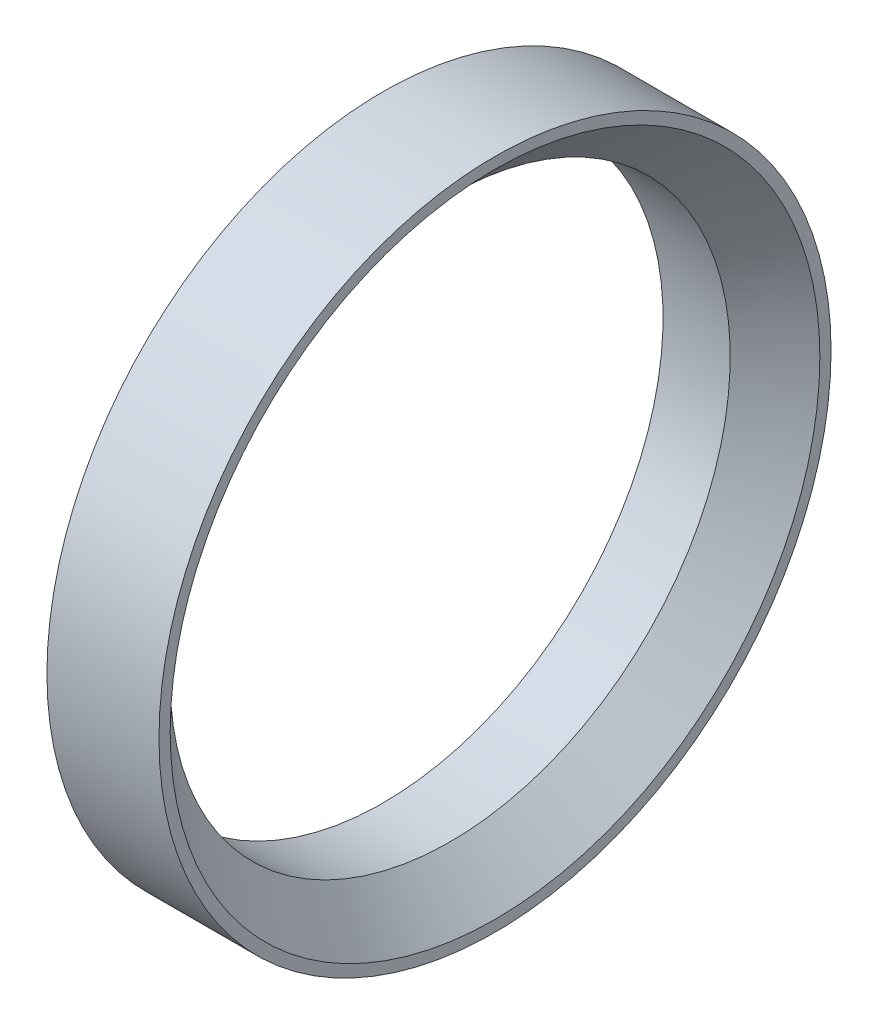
from build123d import *

# Parameters (mm, degrees)
ESQUISSE1_W     = 1
ESQUISSE1_H     = 0.5
CHANFREIN1_SIZE = 0.4


with BuildPart() as part:
    # Esquisse1 → R_volution1 (revolve)
    with BuildSketch(Plane.XY, mode=Mode.PRIVATE) as r_volution1_sk:
        with Locations((4.645368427, 2.75)):
            Rectangle(ESQUISSE1_W, ESQUISSE1_H)
    revolve(r_volution1_sk.sketch.rotate(Axis((-14.76787502, 0, 0), (1, 0, 0)), 90), axis=Axis((-14.76787502, 0, 0), (1, 0, 0)))

    # Chanfrein1
    chanfrein1_edges = [part.edges().sort_by_distance(p)[0] for p in [
        (5.145368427, 0, -2.5),
    ]]
    chamfer(chanfrein1_edges, length=CHANFREIN1_SIZE)


solid = part.part
